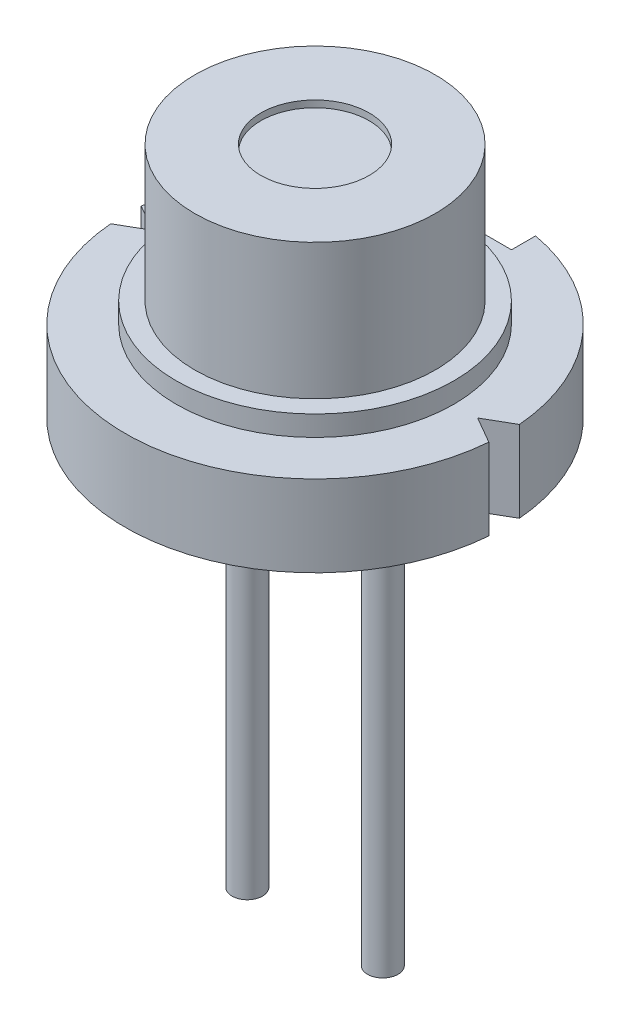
ISO-10303-21;
HEADER;
FILE_DESCRIPTION(('STEP AP214'),'2;1');
FILE_NAME('part.step','',(''),(''),'','','');
FILE_SCHEMA(('AUTOMOTIVE_DESIGN { 1 0 10303 214 1 1 1 1 }'));
ENDSEC;
DATA;
#1=APPLICATION_CONTEXT('core data for automotive mechanical design processes');
#2=APPLICATION_PROTOCOL_DEFINITION('international standard','automotive_design',2000,#1);
#3=PRODUCT_CONTEXT('',#1,'mechanical');
#4=PRODUCT('Part','Part','',(#3));
#5=PRODUCT_RELATED_PRODUCT_CATEGORY('part','',(#4));
#6=PRODUCT_DEFINITION_FORMATION('','',#4);
#7=PRODUCT_DEFINITION_CONTEXT('part definition',#1,'design');
#8=PRODUCT_DEFINITION('design','',#6,#7);
#9=PRODUCT_DEFINITION_SHAPE('','',#8);
#10=(LENGTH_UNIT() NAMED_UNIT(*) SI_UNIT(.MILLI.,.METRE.));
#11=(NAMED_UNIT(*) PLANE_ANGLE_UNIT() SI_UNIT($,.RADIAN.));
#12=(NAMED_UNIT(*) SI_UNIT($,.STERADIAN.) SOLID_ANGLE_UNIT());
#13=UNCERTAINTY_MEASURE_WITH_UNIT(LENGTH_MEASURE(1.E-05),#10,'distance_accuracy_value','');
#14=(GEOMETRIC_REPRESENTATION_CONTEXT(3) GLOBAL_UNCERTAINTY_ASSIGNED_CONTEXT((#13)) GLOBAL_UNIT_ASSIGNED_CONTEXT((#10,
#11,#12)) REPRESENTATION_CONTEXT('',''));
#15=CARTESIAN_POINT('',(0.,0.,0.));
#16=DIRECTION('',(0.,0.,1.));
#17=DIRECTION('',(1.,0.,0.));
#18=AXIS2_PLACEMENT_3D('',#15,#16,#17);
#19=CARTESIAN_POINT('',(0.,1.2,0.));
#20=DIRECTION('',(0.,-1.,0.));
#21=DIRECTION('',(0.,0.,-1.));
#22=AXIS2_PLACEMENT_3D('',#19,#20,#21);
#23=CYLINDRICAL_SURFACE('',#22,2.8);
#24=CARTESIAN_POINT('',(0.,0.,0.));
#25=DIRECTION('',(0.,1.,0.));
#26=DIRECTION('',(0.,0.,1.));
#27=AXIS2_PLACEMENT_3D('',#24,#25,#26);
#28=CIRCLE('',#27,2.8);
#29=CARTESIAN_POINT('',(-0.5,0.,-2.75499546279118));
#30=VERTEX_POINT('',#29);
#31=CARTESIAN_POINT('',(-2.79089023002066,0.,-0.225680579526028));
#32=VERTEX_POINT('',#31);
#33=EDGE_CURVE('E125',#30,#32,#28,.T.);
#34=ORIENTED_EDGE('',*,*,#33,.T.);
#35=DIRECTION('',(0.,1.,0.));
#36=VECTOR('',#35,1.);
#37=CARTESIAN_POINT('',(-2.79089023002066,0.,-0.225680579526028));
#38=LINE('',#37,#36);
#39=CARTESIAN_POINT('',(-2.79089023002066,1.2,-0.225680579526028));
#40=VERTEX_POINT('',#39);
#41=EDGE_CURVE('E109',#32,#40,#38,.T.);
#42=ORIENTED_EDGE('',*,*,#41,.T.);
#43=CARTESIAN_POINT('',(0.,1.2,0.));
#44=DIRECTION('',(0.,1.,0.));
#45=DIRECTION('',(0.,0.,1.));
#46=AXIS2_PLACEMENT_3D('',#43,#44,#45);
#47=CIRCLE('',#46,2.8);
#48=CARTESIAN_POINT('',(-0.5,1.2,-2.75499546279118));
#49=VERTEX_POINT('',#48);
#50=EDGE_CURVE('E137',#49,#40,#47,.T.);
#51=ORIENTED_EDGE('',*,*,#50,.F.);
#52=DIRECTION('',(0.,1.,0.));
#53=VECTOR('',#52,1.);
#54=CARTESIAN_POINT('',(-0.5,0.,-2.75499546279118));
#55=LINE('',#54,#53);
#56=EDGE_CURVE('E130',#30,#49,#55,.T.);
#57=ORIENTED_EDGE('',*,*,#56,.F.);
#58=EDGE_LOOP('',(#34,#42,#51,#57));
#59=FACE_BOUND('',#58,.T.);
#60=ADVANCED_FACE('F34',(#59),#23,.T.);
#61=CARTESIAN_POINT('',(-2.79089023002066,1.2,0.225680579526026));
#62=VERTEX_POINT('',#61);
#63=CARTESIAN_POINT('',(2.79089023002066,1.2,0.225680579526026));
#64=VERTEX_POINT('',#63);
#65=EDGE_CURVE('E135',#62,#64,#47,.T.);
#66=ORIENTED_EDGE('',*,*,#65,.F.);
#67=DIRECTION('',(0.,1.,0.));
#68=VECTOR('',#67,1.);
#69=CARTESIAN_POINT('',(-2.79089023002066,0.,0.225680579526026));
#70=LINE('',#69,#68);
#71=CARTESIAN_POINT('',(-2.79089023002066,0.,0.225680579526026));
#72=VERTEX_POINT('',#71);
#73=EDGE_CURVE('E117',#72,#62,#70,.T.);
#74=ORIENTED_EDGE('',*,*,#73,.F.);
#75=CARTESIAN_POINT('',(2.79089023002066,0.,0.225680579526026));
#76=VERTEX_POINT('',#75);
#77=EDGE_CURVE('E132',#72,#76,#28,.T.);
#78=ORIENTED_EDGE('',*,*,#77,.T.);
#79=DIRECTION('',(0.,1.,0.));
#80=VECTOR('',#79,1.);
#81=CARTESIAN_POINT('',(2.79089023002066,0.,0.225680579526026));
#82=LINE('',#81,#80);
#83=EDGE_CURVE('E175',#76,#64,#82,.T.);
#84=ORIENTED_EDGE('',*,*,#83,.T.);
#85=EDGE_LOOP('',(#66,#74,#78,#84));
#86=FACE_BOUND('',#85,.T.);
#87=ADVANCED_FACE('F174',(#86),#23,.T.);
#88=CARTESIAN_POINT('',(2.79089023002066,1.2,-0.225680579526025));
#89=VERTEX_POINT('',#88);
#90=CARTESIAN_POINT('',(0.5,1.2,-2.75499546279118));
#91=VERTEX_POINT('',#90);
#92=EDGE_CURVE('E131',#89,#91,#47,.T.);
#93=ORIENTED_EDGE('',*,*,#92,.F.);
#94=DIRECTION('',(0.,1.,0.));
#95=VECTOR('',#94,1.);
#96=CARTESIAN_POINT('',(2.79089023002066,0.,-0.225680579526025));
#97=LINE('',#96,#95);
#98=CARTESIAN_POINT('',(2.79089023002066,0.,-0.225680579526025));
#99=VERTEX_POINT('',#98);
#100=EDGE_CURVE('E179',#99,#89,#97,.T.);
#101=ORIENTED_EDGE('',*,*,#100,.F.);
#102=CARTESIAN_POINT('',(0.5,0.,-2.75499546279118));
#103=VERTEX_POINT('',#102);
#104=EDGE_CURVE('E134',#99,#103,#28,.T.);
#105=ORIENTED_EDGE('',*,*,#104,.T.);
#106=DIRECTION('',(0.,1.,0.));
#107=VECTOR('',#106,1.);
#108=CARTESIAN_POINT('',(0.5,0.,-2.75499546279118));
#109=LINE('',#108,#107);
#110=EDGE_CURVE('E203',#103,#91,#109,.T.);
#111=ORIENTED_EDGE('',*,*,#110,.T.);
#112=EDGE_LOOP('',(#93,#101,#105,#111));
#113=FACE_BOUND('',#112,.T.);
#114=ADVANCED_FACE('F238',(#113),#23,.T.);
#115=CARTESIAN_POINT('',(0.,1.2,0.));
#116=DIRECTION('',(0.,1.,0.));
#117=DIRECTION('',(0.,0.,1.));
#118=AXIS2_PLACEMENT_3D('',#115,#116,#117);
#119=PLANE('',#118);
#120=DIRECTION('',(-0.866025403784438,0.,-0.500000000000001));
#121=VECTOR('',#120,1.);
#122=CARTESIAN_POINT('',(-2.4,1.2,0.));
#123=LINE('',#122,#121);
#124=CARTESIAN_POINT('',(-2.4,1.2,0.));
#125=VERTEX_POINT('',#124);
#126=EDGE_CURVE('E112',#125,#40,#123,.T.);
#127=ORIENTED_EDGE('',*,*,#126,.F.);
#128=DIRECTION('',(0.866025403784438,0.,-0.500000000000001));
#129=VECTOR('',#128,1.);
#130=CARTESIAN_POINT('',(-2.4,1.2,0.));
#131=LINE('',#130,#129);
#132=EDGE_CURVE('E127',#62,#125,#131,.T.);
#133=ORIENTED_EDGE('',*,*,#132,.F.);
#134=ORIENTED_EDGE('',*,*,#65,.T.);
#135=DIRECTION('',(0.866025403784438,0.,0.500000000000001));
#136=VECTOR('',#135,1.);
#137=CARTESIAN_POINT('',(2.4,1.2,0.));
#138=LINE('',#137,#136);
#139=CARTESIAN_POINT('',(2.4,1.2,0.));
#140=VERTEX_POINT('',#139);
#141=EDGE_CURVE('E169',#140,#64,#138,.T.);
#142=ORIENTED_EDGE('',*,*,#141,.F.);
#143=DIRECTION('',(-0.866025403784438,0.,0.500000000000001));
#144=VECTOR('',#143,1.);
#145=CARTESIAN_POINT('',(2.4,1.2,0.));
#146=LINE('',#145,#144);
#147=EDGE_CURVE('E253',#89,#140,#146,.T.);
#148=ORIENTED_EDGE('',*,*,#147,.F.);
#149=ORIENTED_EDGE('',*,*,#92,.T.);
#150=DIRECTION('',(0.,0.,-1.));
#151=VECTOR('',#150,1.);
#152=CARTESIAN_POINT('',(0.5,1.2,-2.4));
#153=LINE('',#152,#151);
#154=CARTESIAN_POINT('',(0.5,1.2,-2.4));
#155=VERTEX_POINT('',#154);
#156=EDGE_CURVE('E188',#155,#91,#153,.T.);
#157=ORIENTED_EDGE('',*,*,#156,.F.);
#158=DIRECTION('',(1.,0.,0.));
#159=VECTOR('',#158,1.);
#160=CARTESIAN_POINT('',(0.5,1.2,-2.4));
#161=LINE('',#160,#159);
#162=CARTESIAN_POINT('',(-0.5,1.2,-2.4));
#163=VERTEX_POINT('',#162);
#164=EDGE_CURVE('E197',#163,#155,#161,.T.);
#165=ORIENTED_EDGE('',*,*,#164,.F.);
#166=DIRECTION('',(0.,0.,1.));
#167=VECTOR('',#166,1.);
#168=CARTESIAN_POINT('',(-0.5,1.2,-2.4));
#169=LINE('',#168,#167);
#170=EDGE_CURVE('E194',#49,#163,#169,.T.);
#171=ORIENTED_EDGE('',*,*,#170,.F.);
#172=ORIENTED_EDGE('',*,*,#50,.T.);
#173=EDGE_LOOP('',(#127,#133,#134,#142,#148,#149,#157,#165,#171,#172));
#174=FACE_BOUND('',#173,.T.);
#175=CARTESIAN_POINT('',(0.,1.2,0.));
#176=DIRECTION('',(0.,1.,0.));
#177=DIRECTION('',(0.,0.,1.));
#178=AXIS2_PLACEMENT_3D('',#175,#176,#177);
#179=CIRCLE('',#178,2.05);
#180=CARTESIAN_POINT('',(0.,1.2,2.05));
#181=VERTEX_POINT('',#180);
#182=EDGE_CURVE('E147',#181,#181,#179,.T.);
#183=ORIENTED_EDGE('',*,*,#182,.F.);
#184=EDGE_LOOP('',(#183));
#185=FACE_BOUND('',#184,.T.);
#186=ADVANCED_FACE('F166',(#174,#185),#119,.T.);
#187=CARTESIAN_POINT('',(0.,0.,0.));
#188=DIRECTION('',(0.,1.,0.));
#189=DIRECTION('',(0.,0.,1.));
#190=AXIS2_PLACEMENT_3D('',#187,#188,#189);
#191=PLANE('',#190);
#192=CARTESIAN_POINT('',(1.,0.,0.));
#193=DIRECTION('',(0.,1.,0.));
#194=DIRECTION('',(0.,0.,1.));
#195=AXIS2_PLACEMENT_3D('',#192,#193,#194);
#196=CIRCLE('',#195,0.625);
#197=CARTESIAN_POINT('',(1.,0.,0.625));
#198=VERTEX_POINT('',#197);
#199=EDGE_CURVE('E463',#198,#198,#196,.T.);
#200=ORIENTED_EDGE('',*,*,#199,.T.);
#201=EDGE_LOOP('',(#200));
#202=FACE_BOUND('',#201,.T.);
#203=CARTESIAN_POINT('',(0.,0.,-1.));
#204=DIRECTION('',(0.,1.,0.));
#205=DIRECTION('',(0.,0.,1.));
#206=AXIS2_PLACEMENT_3D('',#203,#204,#205);
#207=CIRCLE('',#206,0.625);
#208=CARTESIAN_POINT('',(0.,0.,-0.375));
#209=VERTEX_POINT('',#208);
#210=EDGE_CURVE('E460',#209,#209,#207,.T.);
#211=ORIENTED_EDGE('',*,*,#210,.T.);
#212=EDGE_LOOP('',(#211));
#213=FACE_BOUND('',#212,.T.);
#214=CARTESIAN_POINT('',(-1.,0.,0.));
#215=DIRECTION('',(0.,1.,0.));
#216=DIRECTION('',(0.,0.,1.));
#217=AXIS2_PLACEMENT_3D('',#214,#215,#216);
#218=CIRCLE('',#217,0.625);
#219=CARTESIAN_POINT('',(-1.,0.,0.625));
#220=VERTEX_POINT('',#219);
#221=EDGE_CURVE('E161',#220,#220,#218,.T.);
#222=ORIENTED_EDGE('',*,*,#221,.T.);
#223=EDGE_LOOP('',(#222));
#224=FACE_BOUND('',#223,.T.);
#225=DIRECTION('',(0.866025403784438,0.,-0.500000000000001));
#226=VECTOR('',#225,1.);
#227=CARTESIAN_POINT('',(-2.4,0.,0.));
#228=LINE('',#227,#226);
#229=CARTESIAN_POINT('',(-2.4,0.,0.));
#230=VERTEX_POINT('',#229);
#231=EDGE_CURVE('E118',#72,#230,#228,.T.);
#232=ORIENTED_EDGE('',*,*,#231,.T.);
#233=DIRECTION('',(-0.866025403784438,0.,-0.500000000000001));
#234=VECTOR('',#233,1.);
#235=CARTESIAN_POINT('',(-2.4,0.,0.));
#236=LINE('',#235,#234);
#237=EDGE_CURVE('E49',#230,#32,#236,.T.);
#238=ORIENTED_EDGE('',*,*,#237,.T.);
#239=ORIENTED_EDGE('',*,*,#33,.F.);
#240=DIRECTION('',(0.,0.,1.));
#241=VECTOR('',#240,1.);
#242=CARTESIAN_POINT('',(-0.5,0.,-2.4));
#243=LINE('',#242,#241);
#244=CARTESIAN_POINT('',(-0.5,0.,-2.4));
#245=VERTEX_POINT('',#244);
#246=EDGE_CURVE('E185',#30,#245,#243,.T.);
#247=ORIENTED_EDGE('',*,*,#246,.T.);
#248=DIRECTION('',(1.,0.,0.));
#249=VECTOR('',#248,1.);
#250=CARTESIAN_POINT('',(0.5,0.,-2.4));
#251=LINE('',#250,#249);
#252=CARTESIAN_POINT('',(0.5,0.,-2.4));
#253=VERTEX_POINT('',#252);
#254=EDGE_CURVE('E187',#245,#253,#251,.T.);
#255=ORIENTED_EDGE('',*,*,#254,.T.);
#256=DIRECTION('',(0.,0.,-1.));
#257=VECTOR('',#256,1.);
#258=CARTESIAN_POINT('',(0.5,0.,-2.4));
#259=LINE('',#258,#257);
#260=EDGE_CURVE('E191',#253,#103,#259,.T.);
#261=ORIENTED_EDGE('',*,*,#260,.T.);
#262=ORIENTED_EDGE('',*,*,#104,.F.);
#263=DIRECTION('',(-0.866025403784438,0.,0.500000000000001));
#264=VECTOR('',#263,1.);
#265=CARTESIAN_POINT('',(2.4,0.,0.));
#266=LINE('',#265,#264);
#267=CARTESIAN_POINT('',(2.4,0.,0.));
#268=VERTEX_POINT('',#267);
#269=EDGE_CURVE('E263',#99,#268,#266,.T.);
#270=ORIENTED_EDGE('',*,*,#269,.T.);
#271=DIRECTION('',(0.866025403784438,0.,0.500000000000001));
#272=VECTOR('',#271,1.);
#273=CARTESIAN_POINT('',(2.4,0.,0.));
#274=LINE('',#273,#272);
#275=EDGE_CURVE('E57',#268,#76,#274,.T.);
#276=ORIENTED_EDGE('',*,*,#275,.T.);
#277=ORIENTED_EDGE('',*,*,#77,.F.);
#278=EDGE_LOOP('',(#232,#238,#239,#247,#255,#261,#262,#270,#276,#277));
#279=FACE_BOUND('',#278,.T.);
#280=ADVANCED_FACE('F123',(#202,#213,#224,#279),#191,.F.);
#281=CARTESIAN_POINT('',(0.,1.5,0.));
#282=DIRECTION('',(0.,-1.,0.));
#283=DIRECTION('',(0.,0.,-1.));
#284=AXIS2_PLACEMENT_3D('',#281,#282,#283);
#285=CYLINDRICAL_SURFACE('',#284,2.05);
#286=CARTESIAN_POINT('',(0.,1.5,0.));
#287=DIRECTION('',(0.,1.,0.));
#288=DIRECTION('',(0.,0.,1.));
#289=AXIS2_PLACEMENT_3D('',#286,#287,#288);
#290=CIRCLE('',#289,2.05);
#291=CARTESIAN_POINT('',(0.,1.5,2.05));
#292=VERTEX_POINT('',#291);
#293=EDGE_CURVE('E140',#292,#292,#290,.T.);
#294=ORIENTED_EDGE('',*,*,#293,.F.);
#295=EDGE_LOOP('',(#294));
#296=FACE_BOUND('',#295,.T.);
#297=ORIENTED_EDGE('',*,*,#182,.T.);
#298=EDGE_LOOP('',(#297));
#299=FACE_BOUND('',#298,.T.);
#300=ADVANCED_FACE('F225',(#296,#299),#285,.T.);
#301=CARTESIAN_POINT('',(0.,1.5,0.));
#302=DIRECTION('',(0.,1.,0.));
#303=DIRECTION('',(0.,0.,1.));
#304=AXIS2_PLACEMENT_3D('',#301,#302,#303);
#305=PLANE('',#304);
#306=CARTESIAN_POINT('',(0.,1.5,0.));
#307=DIRECTION('',(0.,1.,0.));
#308=DIRECTION('',(0.,0.,1.));
#309=AXIS2_PLACEMENT_3D('',#306,#307,#308);
#310=CIRCLE('',#309,1.775);
#311=CARTESIAN_POINT('',(0.,1.5,1.775));
#312=VERTEX_POINT('',#311);
#313=EDGE_CURVE('E155',#312,#312,#310,.T.);
#314=ORIENTED_EDGE('',*,*,#313,.F.);
#315=EDGE_LOOP('',(#314));
#316=FACE_BOUND('',#315,.T.);
#317=ORIENTED_EDGE('',*,*,#293,.T.);
#318=EDGE_LOOP('',(#317));
#319=FACE_BOUND('',#318,.T.);
#320=ADVANCED_FACE('F223',(#316,#319),#305,.T.);
#321=CARTESIAN_POINT('',(0.,3.5,0.));
#322=DIRECTION('',(0.,-1.,0.));
#323=DIRECTION('',(0.,0.,-1.));
#324=AXIS2_PLACEMENT_3D('',#321,#322,#323);
#325=CYLINDRICAL_SURFACE('',#324,1.775);
#326=CARTESIAN_POINT('',(0.,3.5,0.));
#327=DIRECTION('',(0.,1.,0.));
#328=DIRECTION('',(0.,0.,1.));
#329=AXIS2_PLACEMENT_3D('',#326,#327,#328);
#330=CIRCLE('',#329,1.775);
#331=CARTESIAN_POINT('',(0.,3.5,1.775));
#332=VERTEX_POINT('',#331);
#333=EDGE_CURVE('E152',#332,#332,#330,.T.);
#334=ORIENTED_EDGE('',*,*,#333,.F.);
#335=EDGE_LOOP('',(#334));
#336=FACE_BOUND('',#335,.T.);
#337=ORIENTED_EDGE('',*,*,#313,.T.);
#338=EDGE_LOOP('',(#337));
#339=FACE_BOUND('',#338,.T.);
#340=ADVANCED_FACE('F221',(#336,#339),#325,.T.);
#341=CARTESIAN_POINT('',(0.,3.5,0.));
#342=DIRECTION('',(0.,1.,0.));
#343=DIRECTION('',(0.,0.,1.));
#344=AXIS2_PLACEMENT_3D('',#341,#342,#343);
#345=PLANE('',#344);
#346=CARTESIAN_POINT('',(0.,3.5,0.));
#347=DIRECTION('',(0.,1.,0.));
#348=DIRECTION('',(0.,0.,1.));
#349=AXIS2_PLACEMENT_3D('',#346,#347,#348);
#350=CIRCLE('',#349,0.8);
#351=CARTESIAN_POINT('',(0.,3.5,0.8));
#352=VERTEX_POINT('',#351);
#353=EDGE_CURVE('E205',#352,#352,#350,.T.);
#354=ORIENTED_EDGE('',*,*,#353,.F.);
#355=EDGE_LOOP('',(#354));
#356=FACE_BOUND('',#355,.T.);
#357=ORIENTED_EDGE('',*,*,#333,.T.);
#358=EDGE_LOOP('',(#357));
#359=FACE_BOUND('',#358,.T.);
#360=ADVANCED_FACE('F231',(#356,#359),#345,.T.);
#361=CARTESIAN_POINT('',(0.,3.4,0.));
#362=DIRECTION('',(0.,1.,0.));
#363=DIRECTION('',(0.,0.,1.));
#364=AXIS2_PLACEMENT_3D('',#361,#362,#363);
#365=CYLINDRICAL_SURFACE('',#364,0.8);
#366=CARTESIAN_POINT('',(0.,3.4,0.));
#367=DIRECTION('',(0.,1.,0.));
#368=DIRECTION('',(0.,0.,1.));
#369=AXIS2_PLACEMENT_3D('',#366,#367,#368);
#370=CIRCLE('',#369,0.8);
#371=CARTESIAN_POINT('',(0.,3.4,0.8));
#372=VERTEX_POINT('',#371);
#373=EDGE_CURVE('E211',#372,#372,#370,.T.);
#374=ORIENTED_EDGE('',*,*,#373,.F.);
#375=EDGE_LOOP('',(#374));
#376=FACE_BOUND('',#375,.T.);
#377=ORIENTED_EDGE('',*,*,#353,.T.);
#378=EDGE_LOOP('',(#377));
#379=FACE_BOUND('',#378,.T.);
#380=ADVANCED_FACE('F311',(#376,#379),#365,.F.);
#381=CARTESIAN_POINT('',(0.,3.4,0.));
#382=DIRECTION('',(0.,1.,0.));
#383=DIRECTION('',(0.,0.,1.));
#384=AXIS2_PLACEMENT_3D('',#381,#382,#383);
#385=PLANE('',#384);
#386=ORIENTED_EDGE('',*,*,#373,.T.);
#387=EDGE_LOOP('',(#386));
#388=FACE_BOUND('',#387,.T.);
#389=ADVANCED_FACE('F304',(#388),#385,.T.);
#390=CARTESIAN_POINT('',(0.5,0.,-2.4));
#391=DIRECTION('',(1.,0.,0.));
#392=DIRECTION('',(0.,0.,-1.));
#393=AXIS2_PLACEMENT_3D('',#390,#391,#392);
#394=PLANE('',#393);
#395=ORIENTED_EDGE('',*,*,#156,.T.);
#396=ORIENTED_EDGE('',*,*,#110,.F.);
#397=ORIENTED_EDGE('',*,*,#260,.F.);
#398=DIRECTION('',(0.,1.,0.));
#399=VECTOR('',#398,1.);
#400=CARTESIAN_POINT('',(0.5,0.,-2.4));
#401=LINE('',#400,#399);
#402=EDGE_CURVE('E206',#253,#155,#401,.T.);
#403=ORIENTED_EDGE('',*,*,#402,.T.);
#404=EDGE_LOOP('',(#395,#396,#397,#403));
#405=FACE_BOUND('',#404,.T.);
#406=ADVANCED_FACE('F255',(#405),#394,.F.);
#407=CARTESIAN_POINT('',(0.5,0.,-2.4));
#408=DIRECTION('',(0.,0.,1.));
#409=DIRECTION('',(1.,0.,0.));
#410=AXIS2_PLACEMENT_3D('',#407,#408,#409);
#411=PLANE('',#410);
#412=ORIENTED_EDGE('',*,*,#164,.T.);
#413=ORIENTED_EDGE('',*,*,#402,.F.);
#414=ORIENTED_EDGE('',*,*,#254,.F.);
#415=DIRECTION('',(0.,1.,0.));
#416=VECTOR('',#415,1.);
#417=CARTESIAN_POINT('',(-0.5,0.,-2.4));
#418=LINE('',#417,#416);
#419=EDGE_CURVE('E208',#245,#163,#418,.T.);
#420=ORIENTED_EDGE('',*,*,#419,.T.);
#421=EDGE_LOOP('',(#412,#413,#414,#420));
#422=FACE_BOUND('',#421,.T.);
#423=ADVANCED_FACE('F258',(#422),#411,.F.);
#424=CARTESIAN_POINT('',(-0.5,0.,-2.4));
#425=DIRECTION('',(-1.,0.,0.));
#426=DIRECTION('',(0.,0.,1.));
#427=AXIS2_PLACEMENT_3D('',#424,#425,#426);
#428=PLANE('',#427);
#429=ORIENTED_EDGE('',*,*,#170,.T.);
#430=ORIENTED_EDGE('',*,*,#419,.F.);
#431=ORIENTED_EDGE('',*,*,#246,.F.);
#432=ORIENTED_EDGE('',*,*,#56,.T.);
#433=EDGE_LOOP('',(#429,#430,#431,#432));
#434=FACE_BOUND('',#433,.T.);
#435=ADVANCED_FACE('F261',(#434),#428,.F.);
#436=CARTESIAN_POINT('',(2.4,0.,0.));
#437=DIRECTION('',(-0.500000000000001,0.,0.866025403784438));
#438=DIRECTION('',(0.866025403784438,0.,0.500000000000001));
#439=AXIS2_PLACEMENT_3D('',#436,#437,#438);
#440=PLANE('',#439);
#441=ORIENTED_EDGE('',*,*,#141,.T.);
#442=ORIENTED_EDGE('',*,*,#83,.F.);
#443=ORIENTED_EDGE('',*,*,#275,.F.);
#444=DIRECTION('',(0.,1.,0.));
#445=VECTOR('',#444,1.);
#446=CARTESIAN_POINT('',(2.4,0.,0.));
#447=LINE('',#446,#445);
#448=EDGE_CURVE('E176',#268,#140,#447,.T.);
#449=ORIENTED_EDGE('',*,*,#448,.T.);
#450=EDGE_LOOP('',(#441,#442,#443,#449));
#451=FACE_BOUND('',#450,.T.);
#452=ADVANCED_FACE('F297',(#451),#440,.F.);
#453=CARTESIAN_POINT('',(2.4,0.,0.));
#454=DIRECTION('',(-0.500000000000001,0.,-0.866025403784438));
#455=DIRECTION('',(-0.866025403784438,0.,0.500000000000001));
#456=AXIS2_PLACEMENT_3D('',#453,#454,#455);
#457=PLANE('',#456);
#458=ORIENTED_EDGE('',*,*,#147,.T.);
#459=ORIENTED_EDGE('',*,*,#448,.F.);
#460=ORIENTED_EDGE('',*,*,#269,.F.);
#461=ORIENTED_EDGE('',*,*,#100,.T.);
#462=EDGE_LOOP('',(#458,#459,#460,#461));
#463=FACE_BOUND('',#462,.T.);
#464=ADVANCED_FACE('F293',(#463),#457,.F.);
#465=CARTESIAN_POINT('',(-2.4,0.,0.));
#466=DIRECTION('',(0.500000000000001,0.,-0.866025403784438));
#467=DIRECTION('',(-0.866025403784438,0.,-0.500000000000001));
#468=AXIS2_PLACEMENT_3D('',#465,#466,#467);
#469=PLANE('',#468);
#470=ORIENTED_EDGE('',*,*,#126,.T.);
#471=ORIENTED_EDGE('',*,*,#41,.F.);
#472=ORIENTED_EDGE('',*,*,#237,.F.);
#473=DIRECTION('',(0.,1.,0.));
#474=VECTOR('',#473,1.);
#475=CARTESIAN_POINT('',(-2.4,0.,0.));
#476=LINE('',#475,#474);
#477=EDGE_CURVE('E198',#230,#125,#476,.T.);
#478=ORIENTED_EDGE('',*,*,#477,.T.);
#479=EDGE_LOOP('',(#470,#471,#472,#478));
#480=FACE_BOUND('',#479,.T.);
#481=ADVANCED_FACE('F110',(#480),#469,.F.);
#482=CARTESIAN_POINT('',(-2.4,0.,0.));
#483=DIRECTION('',(0.500000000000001,0.,0.866025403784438));
#484=DIRECTION('',(0.866025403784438,0.,-0.500000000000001));
#485=AXIS2_PLACEMENT_3D('',#482,#483,#484);
#486=PLANE('',#485);
#487=ORIENTED_EDGE('',*,*,#132,.T.);
#488=ORIENTED_EDGE('',*,*,#477,.F.);
#489=ORIENTED_EDGE('',*,*,#231,.F.);
#490=ORIENTED_EDGE('',*,*,#73,.T.);
#491=EDGE_LOOP('',(#487,#488,#489,#490));
#492=FACE_BOUND('',#491,.T.);
#493=ADVANCED_FACE('F282',(#492),#486,.F.);
#494=CARTESIAN_POINT('',(-1.,-6.5,0.));
#495=DIRECTION('',(0.,1.,0.));
#496=DIRECTION('',(0.,0.,1.));
#497=AXIS2_PLACEMENT_3D('',#494,#495,#496);
#498=CYLINDRICAL_SURFACE('',#497,0.225);
#499=CARTESIAN_POINT('',(-1.,-0.400000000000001,0.));
#500=DIRECTION('',(0.,1.,0.));
#501=DIRECTION('',(0.,0.,1.));
#502=AXIS2_PLACEMENT_3D('',#499,#500,#501);
#503=CIRCLE('',#502,0.225);
#504=CARTESIAN_POINT('',(-1.,-0.400000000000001,0.225));
#505=VERTEX_POINT('',#504);
#506=EDGE_CURVE('E11',#505,#505,#503,.F.);
#507=ORIENTED_EDGE('',*,*,#506,.T.);
#508=EDGE_LOOP('',(#507));
#509=FACE_BOUND('',#508,.T.);
#510=CARTESIAN_POINT('',(-1.,-6.5,0.));
#511=DIRECTION('',(0.,-1.,0.));
#512=DIRECTION('',(0.,0.,-1.));
#513=AXIS2_PLACEMENT_3D('',#510,#511,#512);
#514=CIRCLE('',#513,0.225);
#515=CARTESIAN_POINT('',(-1.,-6.5,-0.225));
#516=VERTEX_POINT('',#515);
#517=EDGE_CURVE('E268',#516,#516,#514,.T.);
#518=ORIENTED_EDGE('',*,*,#517,.F.);
#519=EDGE_LOOP('',(#518));
#520=FACE_BOUND('',#519,.T.);
#521=ADVANCED_FACE('F284',(#509,#520),#498,.T.);
#522=CARTESIAN_POINT('',(-1.,-6.5,0.));
#523=DIRECTION('',(0.,-1.,0.));
#524=DIRECTION('',(0.,0.,-1.));
#525=AXIS2_PLACEMENT_3D('',#522,#523,#524);
#526=PLANE('',#525);
#527=ORIENTED_EDGE('',*,*,#517,.T.);
#528=EDGE_LOOP('',(#527));
#529=FACE_BOUND('',#528,.T.);
#530=ADVANCED_FACE('F290',(#529),#526,.T.);
#531=CARTESIAN_POINT('',(0.,-6.5,-1.));
#532=DIRECTION('',(0.,1.,0.));
#533=DIRECTION('',(0.,0.,1.));
#534=AXIS2_PLACEMENT_3D('',#531,#532,#533);
#535=CYLINDRICAL_SURFACE('',#534,0.225);
#536=CARTESIAN_POINT('',(0.,-0.400000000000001,-1.));
#537=DIRECTION('',(0.,1.,0.));
#538=DIRECTION('',(0.,0.,1.));
#539=AXIS2_PLACEMENT_3D('',#536,#537,#538);
#540=CIRCLE('',#539,0.225);
#541=CARTESIAN_POINT('',(0.,-0.400000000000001,-0.775));
#542=VERTEX_POINT('',#541);
#543=EDGE_CURVE('E42',#542,#542,#540,.F.);
#544=ORIENTED_EDGE('',*,*,#543,.T.);
#545=EDGE_LOOP('',(#544));
#546=FACE_BOUND('',#545,.T.);
#547=CARTESIAN_POINT('',(0.,-6.5,-1.));
#548=DIRECTION('',(0.,-1.,0.));
#549=DIRECTION('',(0.,0.,-1.));
#550=AXIS2_PLACEMENT_3D('',#547,#548,#549);
#551=CIRCLE('',#550,0.225);
#552=CARTESIAN_POINT('',(0.,-6.5,-1.225));
#553=VERTEX_POINT('',#552);
#554=EDGE_CURVE('E270',#553,#553,#551,.T.);
#555=ORIENTED_EDGE('',*,*,#554,.F.);
#556=EDGE_LOOP('',(#555));
#557=FACE_BOUND('',#556,.T.);
#558=ADVANCED_FACE('F371',(#546,#557),#535,.T.);
#559=CARTESIAN_POINT('',(0.,-6.5,-1.));
#560=DIRECTION('',(0.,-1.,0.));
#561=DIRECTION('',(0.,0.,-1.));
#562=AXIS2_PLACEMENT_3D('',#559,#560,#561);
#563=PLANE('',#562);
#564=ORIENTED_EDGE('',*,*,#554,.T.);
#565=EDGE_LOOP('',(#564));
#566=FACE_BOUND('',#565,.T.);
#567=ADVANCED_FACE('F377',(#566),#563,.T.);
#568=CARTESIAN_POINT('',(1.,-6.5,0.));
#569=DIRECTION('',(0.,1.,0.));
#570=DIRECTION('',(0.,0.,1.));
#571=AXIS2_PLACEMENT_3D('',#568,#569,#570);
#572=CYLINDRICAL_SURFACE('',#571,0.225);
#573=CARTESIAN_POINT('',(1.,-0.400000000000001,0.));
#574=DIRECTION('',(0.,1.,0.));
#575=DIRECTION('',(0.,0.,1.));
#576=AXIS2_PLACEMENT_3D('',#573,#574,#575);
#577=CIRCLE('',#576,0.225);
#578=CARTESIAN_POINT('',(1.,-0.400000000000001,0.225));
#579=VERTEX_POINT('',#578);
#580=EDGE_CURVE('E157',#579,#579,#577,.F.);
#581=ORIENTED_EDGE('',*,*,#580,.T.);
#582=EDGE_LOOP('',(#581));
#583=FACE_BOUND('',#582,.T.);
#584=CARTESIAN_POINT('',(1.,-6.5,0.));
#585=DIRECTION('',(0.,-1.,0.));
#586=DIRECTION('',(0.,0.,-1.));
#587=AXIS2_PLACEMENT_3D('',#584,#585,#586);
#588=CIRCLE('',#587,0.225);
#589=CARTESIAN_POINT('',(1.,-6.5,-0.225));
#590=VERTEX_POINT('',#589);
#591=EDGE_CURVE('E275',#590,#590,#588,.T.);
#592=ORIENTED_EDGE('',*,*,#591,.F.);
#593=EDGE_LOOP('',(#592));
#594=FACE_BOUND('',#593,.T.);
#595=ADVANCED_FACE('F382',(#583,#594),#572,.T.);
#596=CARTESIAN_POINT('',(1.,-6.5,0.));
#597=DIRECTION('',(0.,-1.,0.));
#598=DIRECTION('',(0.,0.,-1.));
#599=AXIS2_PLACEMENT_3D('',#596,#597,#598);
#600=PLANE('',#599);
#601=ORIENTED_EDGE('',*,*,#591,.T.);
#602=EDGE_LOOP('',(#601));
#603=FACE_BOUND('',#602,.T.);
#604=ADVANCED_FACE('F390',(#603),#600,.T.);
#605=CARTESIAN_POINT('',(1.,-0.4,0.));
#606=DIRECTION('',(0.,1.,0.));
#607=DIRECTION('',(0.,0.,1.));
#608=AXIS2_PLACEMENT_3D('',#605,#606,#607);
#609=TOROIDAL_SURFACE('',#608,0.625,0.4);
#610=ORIENTED_EDGE('',*,*,#199,.F.);
#611=EDGE_LOOP('',(#610));
#612=FACE_BOUND('',#611,.T.);
#613=ORIENTED_EDGE('',*,*,#580,.F.);
#614=EDGE_LOOP('',(#613));
#615=FACE_BOUND('',#614,.T.);
#616=ADVANCED_FACE('F395',(#612,#615),#609,.F.);
#617=CARTESIAN_POINT('',(0.,-0.4,-1.));
#618=DIRECTION('',(0.,1.,0.));
#619=DIRECTION('',(0.,0.,1.));
#620=AXIS2_PLACEMENT_3D('',#617,#618,#619);
#621=TOROIDAL_SURFACE('',#620,0.625,0.4);
#622=ORIENTED_EDGE('',*,*,#210,.F.);
#623=EDGE_LOOP('',(#622));
#624=FACE_BOUND('',#623,.T.);
#625=ORIENTED_EDGE('',*,*,#543,.F.);
#626=EDGE_LOOP('',(#625));
#627=FACE_BOUND('',#626,.T.);
#628=ADVANCED_FACE('F434',(#624,#627),#621,.F.);
#629=CARTESIAN_POINT('',(-1.,-0.4,0.));
#630=DIRECTION('',(0.,1.,0.));
#631=DIRECTION('',(0.,0.,1.));
#632=AXIS2_PLACEMENT_3D('',#629,#630,#631);
#633=TOROIDAL_SURFACE('',#632,0.625,0.4);
#634=ORIENTED_EDGE('',*,*,#221,.F.);
#635=EDGE_LOOP('',(#634));
#636=FACE_BOUND('',#635,.T.);
#637=ORIENTED_EDGE('',*,*,#506,.F.);
#638=EDGE_LOOP('',(#637));
#639=FACE_BOUND('',#638,.T.);
#640=ADVANCED_FACE('F36',(#636,#639),#633,.F.);
#641=CLOSED_SHELL('',(#60,#87,#114,#186,#280,#300,#320,#340,#360,#380,#389,#406,#423,#435,#452,
#464,#481,#493,#521,#530,#558,#567,#595,#604,#616,#628,#640));
#642=MANIFOLD_SOLID_BREP('B2',#641);
#643=ADVANCED_BREP_SHAPE_REPRESENTATION('',(#18,#642),#14);
#644=SHAPE_DEFINITION_REPRESENTATION(#9,#643);
ENDSEC;
END-ISO-10303-21;
